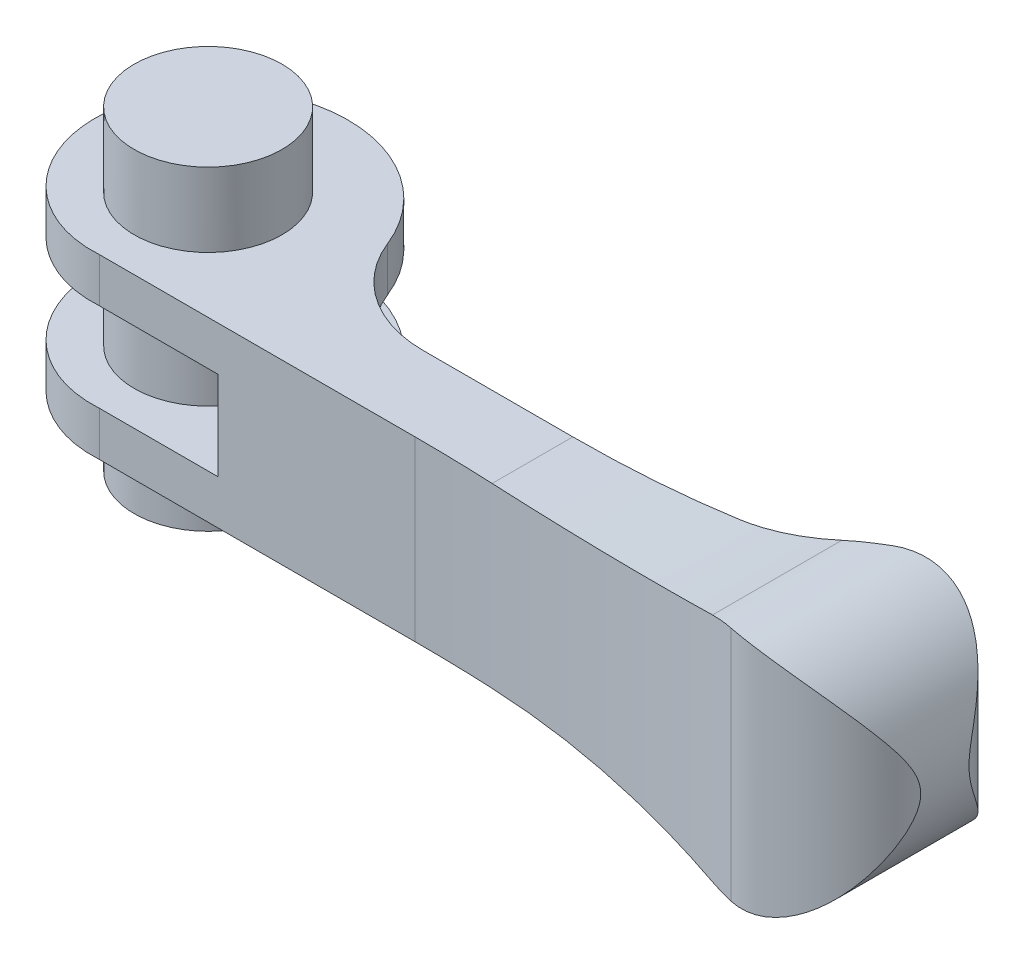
ISO-10303-21;
HEADER;
FILE_DESCRIPTION(('STEP AP214'),'2;1');
FILE_NAME('part.step','',(''),(''),'','','');
FILE_SCHEMA(('AUTOMOTIVE_DESIGN { 1 0 10303 214 1 1 1 1 }'));
ENDSEC;
DATA;
#1=APPLICATION_CONTEXT('core data for automotive mechanical design processes');
#2=APPLICATION_PROTOCOL_DEFINITION('international standard','automotive_design',2000,#1);
#3=PRODUCT_CONTEXT('',#1,'mechanical');
#4=PRODUCT('Part','Part','',(#3));
#5=PRODUCT_RELATED_PRODUCT_CATEGORY('part','',(#4));
#6=PRODUCT_DEFINITION_FORMATION('','',#4);
#7=PRODUCT_DEFINITION_CONTEXT('part definition',#1,'design');
#8=PRODUCT_DEFINITION('design','',#6,#7);
#9=PRODUCT_DEFINITION_SHAPE('','',#8);
#10=(LENGTH_UNIT() NAMED_UNIT(*) SI_UNIT(.MILLI.,.METRE.));
#11=(NAMED_UNIT(*) PLANE_ANGLE_UNIT() SI_UNIT($,.RADIAN.));
#12=(NAMED_UNIT(*) SI_UNIT($,.STERADIAN.) SOLID_ANGLE_UNIT());
#13=UNCERTAINTY_MEASURE_WITH_UNIT(LENGTH_MEASURE(1.E-05),#10,'distance_accuracy_value','');
#14=(GEOMETRIC_REPRESENTATION_CONTEXT(3) GLOBAL_UNCERTAINTY_ASSIGNED_CONTEXT((#13)) GLOBAL_UNIT_ASSIGNED_CONTEXT((#10,
#11,#12)) REPRESENTATION_CONTEXT('',''));
#15=CARTESIAN_POINT('',(0.,0.,0.));
#16=DIRECTION('',(0.,0.,1.));
#17=DIRECTION('',(1.,0.,0.));
#18=AXIS2_PLACEMENT_3D('',#15,#16,#17);
#19=CARTESIAN_POINT('',(32.,-12.,183.));
#20=DIRECTION('',(0.,1.,0.));
#21=DIRECTION('',(1.,0.,0.));
#22=AXIS2_PLACEMENT_3D('',#19,#20,#21);
#23=CYLINDRICAL_SURFACE('',#22,172.);
#24=CARTESIAN_POINT('',(65.4577553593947,11.7276166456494,14.2855115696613));
#25=CARTESIAN_POINT('',(65.6518253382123,11.7696913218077,14.3239954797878));
#26=CARTESIAN_POINT('',(65.8468221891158,11.8069140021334,14.3630148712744));
#27=CARTESIAN_POINT('',(66.2377621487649,11.8715471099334,14.4419534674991));
#28=CARTESIAN_POINT('',(66.4337019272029,11.8989805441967,14.4818703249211));
#29=CARTESIAN_POINT('',(67.0233117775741,11.9667391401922,14.6030598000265));
#30=CARTESIAN_POINT('',(67.4184272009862,11.9924480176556,14.6857029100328));
#31=CARTESIAN_POINT('',(67.813698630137,11.9985537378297,14.7698630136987));
#32=B_SPLINE_CURVE_WITH_KNOTS('',3,(#24,#25,#26,#27,#28,#29,#30,#31),.UNSPECIFIED.,.F.,.F.,(4,2,
2,4),(0.,0.606723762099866,1.2120120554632,2.42366281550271),.UNSPECIFIED.);
#33=CARTESIAN_POINT('',(65.4577553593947,11.7276166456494,14.2855115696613));
#34=VERTEX_POINT('',#33);
#35=CARTESIAN_POINT('',(67.813698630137,11.9985537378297,14.7698630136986));
#36=VERTEX_POINT('',#35);
#37=EDGE_CURVE('E177',#34,#36,#32,.T.);
#38=ORIENTED_EDGE('',*,*,#37,.F.);
#39=CARTESIAN_POINT('',(40.,9.,11.1861472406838));
#40=CARTESIAN_POINT('',(41.0786495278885,8.99998998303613,11.236360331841));
#41=CARTESIAN_POINT('',(42.1568138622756,9.01452328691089,11.2967523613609));
#42=CARTESIAN_POINT('',(44.3110259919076,9.07252358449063,11.4377582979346));
#43=CARTESIAN_POINT('',(45.3870738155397,9.11599018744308,11.5183719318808));
#44=CARTESIAN_POINT('',(47.5315233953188,9.2314665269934,11.6993141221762));
#45=CARTESIAN_POINT('',(48.5999384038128,9.30335830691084,11.7995603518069));
#46=CARTESIAN_POINT('',(50.7323922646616,9.47544657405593,12.0197470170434));
#47=CARTESIAN_POINT('',(51.7964311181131,9.57564305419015,12.1396874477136));
#48=CARTESIAN_POINT('',(54.9804202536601,9.91831356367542,12.5286842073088));
#49=CARTESIAN_POINT('',(57.0925861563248,10.2028872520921,12.8269450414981));
#50=CARTESIAN_POINT('',(60.2423967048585,10.7124052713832,13.3311883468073));
#51=CARTESIAN_POINT('',(61.2914624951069,10.8964990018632,13.50918245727));
#52=CARTESIAN_POINT('',(63.3811325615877,11.2918145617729,13.8836170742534));
#53=CARTESIAN_POINT('',(64.4217370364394,11.5030357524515,14.0800571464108));
#54=CARTESIAN_POINT('',(65.4577553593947,11.7276166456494,14.2855115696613));
#55=B_SPLINE_CURVE_WITH_KNOTS('',3,(#39,#40,#41,#42,#43,#44,#45,#46,#47,#48,#49,#50,#51,#52,#53,
#54),.UNSPECIFIED.,.F.,.F.,(4,2,2,2,2,2,2,4),(0.,3.23928692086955,6.47853009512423,
9.70447004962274,12.9304091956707,19.3812550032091,22.6204269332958,25.8595226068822),.UNSPECIFIED.);
#56=CARTESIAN_POINT('',(40.,9.,11.1861472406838));
#57=VERTEX_POINT('',#56);
#58=EDGE_CURVE('E145',#57,#34,#55,.T.);
#59=ORIENTED_EDGE('',*,*,#58,.F.);
#60=CARTESIAN_POINT('',(32.,9.,183.));
#61=DIRECTION('',(0.,1.,0.));
#62=DIRECTION('',(1.,0.,0.));
#63=AXIS2_PLACEMENT_3D('',#60,#61,#62);
#64=CIRCLE('',#63,172.);
#65=CARTESIAN_POINT('',(32.,9.,11.));
#66=VERTEX_POINT('',#65);
#67=EDGE_CURVE('E154',#66,#57,#64,.F.);
#68=ORIENTED_EDGE('',*,*,#67,.F.);
#69=DIRECTION('',(0.,1.,0.));
#70=VECTOR('',#69,1.);
#71=CARTESIAN_POINT('',(32.,-12.,11.));
#72=LINE('',#71,#70);
#73=CARTESIAN_POINT('',(32.,-9.,11.));
#74=VERTEX_POINT('',#73);
#75=EDGE_CURVE('E303',#74,#66,#72,.T.);
#76=ORIENTED_EDGE('',*,*,#75,.F.);
#77=CARTESIAN_POINT('',(32.,-9.,183.));
#78=DIRECTION('',(0.,1.,0.));
#79=DIRECTION('',(1.,0.,0.));
#80=AXIS2_PLACEMENT_3D('',#77,#78,#79);
#81=CIRCLE('',#80,172.);
#82=CARTESIAN_POINT('',(40.,-9.,11.1861472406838));
#83=VERTEX_POINT('',#82);
#84=EDGE_CURVE('E511',#74,#83,#81,.F.);
#85=ORIENTED_EDGE('',*,*,#84,.T.);
#86=CARTESIAN_POINT('',(40.,-9.,11.1861472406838));
#87=CARTESIAN_POINT('',(41.0786495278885,-8.99998998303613,11.236360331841));
#88=CARTESIAN_POINT('',(42.1568138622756,-9.01452328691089,11.2967523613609));
#89=CARTESIAN_POINT('',(44.3110259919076,-9.07252358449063,11.4377582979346));
#90=CARTESIAN_POINT('',(45.3870738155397,-9.11599018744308,11.5183719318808));
#91=CARTESIAN_POINT('',(47.5315233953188,-9.2314665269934,11.6993141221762));
#92=CARTESIAN_POINT('',(48.5999384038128,-9.30335830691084,11.7995603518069));
#93=CARTESIAN_POINT('',(50.7323922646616,-9.47544657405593,12.0197470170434));
#94=CARTESIAN_POINT('',(51.7964311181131,-9.57564305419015,12.1396874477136));
#95=CARTESIAN_POINT('',(54.9804202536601,-9.91831356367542,12.5286842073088));
#96=CARTESIAN_POINT('',(57.0925861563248,-10.2028872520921,12.8269450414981));
#97=CARTESIAN_POINT('',(60.2423967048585,-10.7124052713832,13.3311883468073));
#98=CARTESIAN_POINT('',(61.2914624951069,-10.8964990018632,13.50918245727));
#99=CARTESIAN_POINT('',(63.3811325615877,-11.2918145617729,13.8836170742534));
#100=CARTESIAN_POINT('',(64.4217370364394,-11.5030357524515,14.0800571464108));
#101=CARTESIAN_POINT('',(65.4577553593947,-11.7276166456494,14.2855115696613));
#102=B_SPLINE_CURVE_WITH_KNOTS('',3,(#86,#87,#88,#89,#90,#91,#92,#93,#94,#95,#96,#97,#98,#99,
#100,#101),.UNSPECIFIED.,.F.,.F.,(4,2,2,2,2,2,2,4),(0.,3.23928692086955,6.47853009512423,
9.70447004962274,12.9304091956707,19.3812550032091,22.6204269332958,25.8595226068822),.UNSPECIFIED.);
#103=CARTESIAN_POINT('',(65.4577553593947,-11.7276166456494,14.2855115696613));
#104=VERTEX_POINT('',#103);
#105=EDGE_CURVE('E512',#83,#104,#102,.T.);
#106=ORIENTED_EDGE('',*,*,#105,.T.);
#107=CARTESIAN_POINT('',(65.4577553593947,-11.7276166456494,14.2855115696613));
#108=CARTESIAN_POINT('',(65.6518253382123,-11.7696913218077,14.3239954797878));
#109=CARTESIAN_POINT('',(65.8468221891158,-11.8069140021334,14.3630148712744));
#110=CARTESIAN_POINT('',(66.2377621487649,-11.8715471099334,14.4419534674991));
#111=CARTESIAN_POINT('',(66.4337019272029,-11.8989805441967,14.4818703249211));
#112=CARTESIAN_POINT('',(67.0233117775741,-11.9667391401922,14.6030598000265));
#113=CARTESIAN_POINT('',(67.4184272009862,-11.9924480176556,14.6857029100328));
#114=CARTESIAN_POINT('',(67.813698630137,-11.9985537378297,14.7698630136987));
#115=B_SPLINE_CURVE_WITH_KNOTS('',3,(#107,#108,#109,#110,#111,#112,#113,#114),.UNSPECIFIED.,.F.,
.F.,(4,2,2,4),(0.,0.606723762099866,1.2120120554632,2.42366281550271),.UNSPECIFIED.);
#116=CARTESIAN_POINT('',(67.813698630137,-11.9985537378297,14.7698630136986));
#117=VERTEX_POINT('',#116);
#118=EDGE_CURVE('E223',#104,#117,#115,.T.);
#119=ORIENTED_EDGE('',*,*,#118,.T.);
#120=DIRECTION('',(0.,1.,0.));
#121=VECTOR('',#120,1.);
#122=CARTESIAN_POINT('',(67.813698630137,-12.,14.7698630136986));
#123=LINE('',#122,#121);
#124=EDGE_CURVE('E286',#117,#36,#123,.T.);
#125=ORIENTED_EDGE('',*,*,#124,.T.);
#126=EDGE_LOOP('',(#38,#59,#68,#76,#85,#106,#119,#125));
#127=FACE_BOUND('',#126,.T.);
#128=ADVANCED_FACE('F14',(#127),#23,.F.);
#129=CARTESIAN_POINT('',(-1.15218884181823E-13,-12.,11.));
#130=DIRECTION('',(0.,0.,-1.));
#131=DIRECTION('',(1.,0.,0.));
#132=AXIS2_PLACEMENT_3D('',#129,#130,#131);
#133=PLANE('',#132);
#134=DIRECTION('',(1.,0.,0.));
#135=VECTOR('',#134,1.);
#136=CARTESIAN_POINT('',(-1.17217041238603E-13,9.,11.));
#137=LINE('',#136,#135);
#138=CARTESIAN_POINT('',(-1.15218884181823E-13,9.,11.));
#139=VERTEX_POINT('',#138);
#140=EDGE_CURVE('E165',#139,#66,#137,.T.);
#141=ORIENTED_EDGE('',*,*,#140,.F.);
#142=DIRECTION('',(0.,1.,0.));
#143=VECTOR('',#142,1.);
#144=CARTESIAN_POINT('',(-1.15218884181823E-13,-12.,11.));
#145=LINE('',#144,#143);
#146=CARTESIAN_POINT('',(-1.15218884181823E-13,4.5,11.));
#147=VERTEX_POINT('',#146);
#148=EDGE_CURVE('E294',#147,#139,#145,.T.);
#149=ORIENTED_EDGE('',*,*,#148,.F.);
#150=DIRECTION('',(1.,0.,0.));
#151=VECTOR('',#150,1.);
#152=CARTESIAN_POINT('',(-1.13133819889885E-13,4.5,11.));
#153=LINE('',#152,#151);
#154=CARTESIAN_POINT('',(12.,4.5,11.));
#155=VERTEX_POINT('',#154);
#156=EDGE_CURVE('E42',#147,#155,#153,.T.);
#157=ORIENTED_EDGE('',*,*,#156,.T.);
#158=DIRECTION('',(0.,-1.,0.));
#159=VECTOR('',#158,1.);
#160=CARTESIAN_POINT('',(12.,-12.,11.));
#161=LINE('',#160,#159);
#162=CARTESIAN_POINT('',(12.,-4.5,11.));
#163=VERTEX_POINT('',#162);
#164=EDGE_CURVE('E367',#155,#163,#161,.T.);
#165=ORIENTED_EDGE('',*,*,#164,.T.);
#166=DIRECTION('',(-1.,0.,0.));
#167=VECTOR('',#166,1.);
#168=CARTESIAN_POINT('',(-1.14271127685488E-13,-4.5,11.));
#169=LINE('',#168,#167);
#170=CARTESIAN_POINT('',(-1.15218884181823E-13,-4.5,11.));
#171=VERTEX_POINT('',#170);
#172=EDGE_CURVE('E361',#163,#171,#169,.T.);
#173=ORIENTED_EDGE('',*,*,#172,.T.);
#174=CARTESIAN_POINT('',(-1.15218884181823E-13,-9.,11.));
#175=VERTEX_POINT('',#174);
#176=EDGE_CURVE('E298',#175,#171,#145,.T.);
#177=ORIENTED_EDGE('',*,*,#176,.F.);
#178=DIRECTION('',(1.,0.,0.));
#179=VECTOR('',#178,1.);
#180=CARTESIAN_POINT('',(-1.14933433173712E-13,-9.,11.));
#181=LINE('',#180,#179);
#182=EDGE_CURVE('E514',#175,#74,#181,.T.);
#183=ORIENTED_EDGE('',*,*,#182,.T.);
#184=ORIENTED_EDGE('',*,*,#75,.T.);
#185=EDGE_LOOP('',(#141,#149,#157,#165,#173,#177,#183,#184));
#186=FACE_BOUND('',#185,.T.);
#187=ADVANCED_FACE('F274',(#186),#133,.F.);
#188=CARTESIAN_POINT('',(-1.15218884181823E-13,-12.,11.));
#189=CARTESIAN_POINT('',(-1.43989663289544,-12.,11.1006875));
#190=CARTESIAN_POINT('',(-2.91975951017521,-12.,10.9148769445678));
#191=CARTESIAN_POINT('',(-5.73046463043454,-12.,9.96861149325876));
#192=CARTESIAN_POINT('',(-7.06008014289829,-12.,9.20823718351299));
#193=CARTESIAN_POINT('',(-9.35063081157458,-12.,7.20247377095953));
#194=CARTESIAN_POINT('',(-10.3104414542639,-12.,5.95765057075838));
#195=CARTESIAN_POINT('',(-11.6893244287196,-12.,3.15495082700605));
#196=CARTESIAN_POINT('',(-12.1075625,-12.,1.59805618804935));
#197=CARTESIAN_POINT('',(-12.3089375,-12.,-1.59805618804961));
#198=CARTESIAN_POINT('',(-12.0916794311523,-12.,-3.23601639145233));
#199=CARTESIAN_POINT('',(-11.0243638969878,-12.,-6.33896226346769));
#200=CARTESIAN_POINT('',(-10.1744346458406,-12.,-7.80260621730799));
#201=CARTESIAN_POINT('',(-7.94499984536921,-12.,-10.3168282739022));
#202=CARTESIAN_POINT('',(-6.56614820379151,-12.,-11.366193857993));
#203=CARTESIAN_POINT('',(-3.47120770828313,-12.,-12.8661269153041));
#204=CARTESIAN_POINT('',(-1.75621574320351,-12.,-13.3158125));
#205=CARTESIAN_POINT('',(1.75621574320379,-12.,-13.5171875));
#206=CARTESIAN_POINT('',(3.55227327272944,-12.,-13.2684819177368));
#207=CARTESIAN_POINT('',(6.94745989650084,-12.,-12.0801163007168));
#208=CARTESIAN_POINT('',(8.54513229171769,-12.,-11.1406321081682));
#209=CARTESIAN_POINT('',(11.2830257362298,-12.,-8.6875259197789));
#210=CARTESIAN_POINT('',(12.421946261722,-12.,-7.17464583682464));
#211=CARTESIAN_POINT('',(14.0429294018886,-12.,-3.78746458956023));
#212=CARTESIAN_POINT('',(14.5240625,-12.,-1.91437529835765));
#213=CARTESIAN_POINT('',(14.7254375,-12.,1.91437529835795));
#214=CARTESIAN_POINT('',(14.4452844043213,-12.,3.86853015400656));
#215=CARTESIAN_POINT('',(13.1358687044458,-12.,7.555957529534));
#216=CARTESIAN_POINT('',(12.1068295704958,-12.,9.28765836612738));
#217=CARTESIAN_POINT('',(9.43005199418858,-12.,12.2492231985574));
#218=CARTESIAN_POINT('',(7.78314346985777,-12.,13.4776986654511));
#219=CARTESIAN_POINT('',(4.10372147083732,-12.,15.2197318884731));
#220=CARTESIAN_POINT('',(2.0725348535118,-12.,15.7323125));
#221=CARTESIAN_POINT('',(-1.6196390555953E-13,-12.,15.833));
#222=B_SPLINE_CURVE_WITH_KNOTS('',3,(#188,#189,#190,#191,#192,#193,#194,#195,#196,#197,#198,
#199,#200,#201,#202,#203,#204,#205,#206,#207,#208,#209,#210,#211,#212,#213,#214,#215,#216,#217,
#218,#219,#220,#221),.UNSPECIFIED.,.F.,.F.,(4,2,2,2,2,2,2,2,2,2,2,2,2,2,2,2,4),(0.,0.0625,0.125,
0.1875,0.25,0.3125,0.375,0.4375,0.5,0.5625,0.625,0.6875,0.75,0.8125,0.875,0.9375,1.),.UNSPECIFIED.);
#223=DIRECTION('',(0.,1.,0.));
#224=VECTOR('',#223,1.);
#225=SURFACE_OF_LINEAR_EXTRUSION('',#222,#224);
#226=CARTESIAN_POINT('',(-1.15218884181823E-13,9.,11.));
#227=CARTESIAN_POINT('',(-1.43989663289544,9.,11.1006875));
#228=CARTESIAN_POINT('',(-2.91975951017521,9.,10.9148769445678));
#229=CARTESIAN_POINT('',(-5.73046463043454,9.,9.96861149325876));
#230=CARTESIAN_POINT('',(-7.06008014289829,9.,9.20823718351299));
#231=CARTESIAN_POINT('',(-9.35063081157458,9.,7.20247377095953));
#232=CARTESIAN_POINT('',(-10.3104414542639,9.,5.95765057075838));
#233=CARTESIAN_POINT('',(-11.6893244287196,9.,3.15495082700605));
#234=CARTESIAN_POINT('',(-12.1075625,9.,1.59805618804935));
#235=CARTESIAN_POINT('',(-12.3089375,9.,-1.59805618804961));
#236=CARTESIAN_POINT('',(-12.0916794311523,9.,-3.23601639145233));
#237=CARTESIAN_POINT('',(-11.0243638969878,9.,-6.33896226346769));
#238=CARTESIAN_POINT('',(-10.1744346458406,9.,-7.80260621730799));
#239=CARTESIAN_POINT('',(-7.94499984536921,9.,-10.3168282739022));
#240=CARTESIAN_POINT('',(-6.56614820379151,9.,-11.366193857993));
#241=CARTESIAN_POINT('',(-3.47120770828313,9.,-12.8661269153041));
#242=CARTESIAN_POINT('',(-1.75621574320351,9.,-13.3158125));
#243=CARTESIAN_POINT('',(1.75621574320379,9.,-13.5171875));
#244=CARTESIAN_POINT('',(3.55227327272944,9.,-13.2684819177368));
#245=CARTESIAN_POINT('',(6.94745989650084,9.,-12.0801163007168));
#246=CARTESIAN_POINT('',(8.54513229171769,9.,-11.1406321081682));
#247=CARTESIAN_POINT('',(11.2830257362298,9.,-8.6875259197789));
#248=CARTESIAN_POINT('',(12.421946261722,9.,-7.17464583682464));
#249=CARTESIAN_POINT('',(14.0429294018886,9.,-3.78746458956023));
#250=CARTESIAN_POINT('',(14.5240625,9.,-1.91437529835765));
#251=CARTESIAN_POINT('',(14.7254375,9.,1.91437529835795));
#252=CARTESIAN_POINT('',(14.4452844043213,9.,3.86853015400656));
#253=CARTESIAN_POINT('',(13.1358687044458,9.,7.555957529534));
#254=CARTESIAN_POINT('',(12.1068295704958,9.,9.28765836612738));
#255=CARTESIAN_POINT('',(9.43005199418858,9.,12.2492231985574));
#256=CARTESIAN_POINT('',(7.78314346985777,9.,13.4776986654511));
#257=CARTESIAN_POINT('',(4.10372147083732,9.,15.2197318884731));
#258=CARTESIAN_POINT('',(2.0725348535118,9.,15.7323125));
#259=CARTESIAN_POINT('',(-1.6196390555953E-13,9.,15.833));
#260=B_SPLINE_CURVE_WITH_KNOTS('',3,(#226,#227,#228,#229,#230,#231,#232,#233,#234,#235,#236,
#237,#238,#239,#240,#241,#242,#243,#244,#245,#246,#247,#248,#249,#250,#251,#252,#253,#254,#255,
#256,#257,#258,#259),.UNSPECIFIED.,.F.,.F.,(4,2,2,2,2,2,2,2,2,2,2,2,2,2,2,2,4),(0.,0.0625,0.125,
0.1875,0.25,0.3125,0.375,0.4375,0.5,0.5625,0.625,0.6875,0.75,0.8125,0.875,0.9375,1.),.UNSPECIFIED.);
#261=CARTESIAN_POINT('',(13.6259439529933,9.,-4.57987700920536));
#262=VERTEX_POINT('',#261);
#263=EDGE_CURVE('E163',#262,#139,#260,.F.);
#264=ORIENTED_EDGE('',*,*,#263,.F.);
#265=DIRECTION('',(0.,1.,0.));
#266=VECTOR('',#265,1.);
#267=CARTESIAN_POINT('',(13.6259439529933,12.,-4.57987700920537));
#268=LINE('',#267,#266);
#269=CARTESIAN_POINT('',(13.6259439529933,4.5,-4.57987700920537));
#270=VERTEX_POINT('',#269);
#271=EDGE_CURVE('E35',#262,#270,#268,.F.);
#272=ORIENTED_EDGE('',*,*,#271,.T.);
#273=CARTESIAN_POINT('',(-1.15218884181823E-13,4.5,11.));
#274=CARTESIAN_POINT('',(-1.43989663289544,4.5,11.1006875));
#275=CARTESIAN_POINT('',(-2.91975951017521,4.5,10.9148769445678));
#276=CARTESIAN_POINT('',(-5.73046463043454,4.5,9.96861149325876));
#277=CARTESIAN_POINT('',(-7.06008014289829,4.5,9.20823718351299));
#278=CARTESIAN_POINT('',(-9.35063081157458,4.5,7.20247377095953));
#279=CARTESIAN_POINT('',(-10.3104414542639,4.5,5.95765057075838));
#280=CARTESIAN_POINT('',(-11.6893244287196,4.5,3.15495082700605));
#281=CARTESIAN_POINT('',(-12.1075625,4.5,1.59805618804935));
#282=CARTESIAN_POINT('',(-12.3089375,4.5,-1.59805618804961));
#283=CARTESIAN_POINT('',(-12.0916794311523,4.5,-3.23601639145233));
#284=CARTESIAN_POINT('',(-11.0243638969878,4.5,-6.33896226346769));
#285=CARTESIAN_POINT('',(-10.1744346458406,4.5,-7.80260621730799));
#286=CARTESIAN_POINT('',(-7.94499984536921,4.5,-10.3168282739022));
#287=CARTESIAN_POINT('',(-6.56614820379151,4.5,-11.366193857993));
#288=CARTESIAN_POINT('',(-3.47120770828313,4.5,-12.8661269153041));
#289=CARTESIAN_POINT('',(-1.75621574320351,4.5,-13.3158125));
#290=CARTESIAN_POINT('',(1.75621574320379,4.5,-13.5171875));
#291=CARTESIAN_POINT('',(3.55227327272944,4.5,-13.2684819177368));
#292=CARTESIAN_POINT('',(6.94745989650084,4.5,-12.0801163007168));
#293=CARTESIAN_POINT('',(8.54513229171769,4.5,-11.1406321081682));
#294=CARTESIAN_POINT('',(11.2830257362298,4.5,-8.6875259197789));
#295=CARTESIAN_POINT('',(12.421946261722,4.5,-7.17464583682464));
#296=CARTESIAN_POINT('',(14.0429294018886,4.5,-3.78746458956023));
#297=CARTESIAN_POINT('',(14.5240625,4.5,-1.91437529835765));
#298=CARTESIAN_POINT('',(14.7254375,4.5,1.91437529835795));
#299=CARTESIAN_POINT('',(14.4452844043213,4.5,3.86853015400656));
#300=CARTESIAN_POINT('',(13.1358687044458,4.5,7.555957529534));
#301=CARTESIAN_POINT('',(12.1068295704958,4.5,9.28765836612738));
#302=CARTESIAN_POINT('',(9.43005199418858,4.5,12.2492231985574));
#303=CARTESIAN_POINT('',(7.78314346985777,4.5,13.4776986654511));
#304=CARTESIAN_POINT('',(4.10372147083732,4.5,15.2197318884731));
#305=CARTESIAN_POINT('',(2.0725348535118,4.5,15.7323125));
#306=CARTESIAN_POINT('',(-1.6196390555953E-13,4.5,15.833));
#307=B_SPLINE_CURVE_WITH_KNOTS('',3,(#273,#274,#275,#276,#277,#278,#279,#280,#281,#282,#283,
#284,#285,#286,#287,#288,#289,#290,#291,#292,#293,#294,#295,#296,#297,#298,#299,#300,#301,#302,
#303,#304,#305,#306),.UNSPECIFIED.,.F.,.F.,(4,2,2,2,2,2,2,2,2,2,2,2,2,2,2,2,4),(0.,0.0625,0.125,
0.1875,0.25,0.3125,0.375,0.4375,0.5,0.5625,0.625,0.6875,0.75,0.8125,0.875,0.9375,1.),.UNSPECIFIED.);
#308=EDGE_CURVE('E309',#270,#147,#307,.F.);
#309=ORIENTED_EDGE('',*,*,#308,.T.);
#310=ORIENTED_EDGE('',*,*,#148,.T.);
#311=EDGE_LOOP('',(#264,#272,#309,#310));
#312=FACE_BOUND('',#311,.T.);
#313=ADVANCED_FACE('F280',(#312),#225,.F.);
#314=CARTESIAN_POINT('',(14.473395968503,-12.,3.));
#315=DIRECTION('',(0.,0.,1.));
#316=DIRECTION('',(-1.,0.,0.));
#317=AXIS2_PLACEMENT_3D('',#314,#315,#316);
#318=PLANE('',#317);
#319=CARTESIAN_POINT('',(40.,129.166666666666,3.));
#320=DIRECTION('',(0.,0.,1.));
#321=DIRECTION('',(-1.,0.,0.));
#322=AXIS2_PLACEMENT_3D('',#319,#320,#321);
#323=CIRCLE('',#322,120.166666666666);
#324=CARTESIAN_POINT('',(56.8754845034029,10.1908464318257,3.));
#325=VERTEX_POINT('',#324);
#326=CARTESIAN_POINT('',(40.,9.,3.));
#327=VERTEX_POINT('',#326);
#328=EDGE_CURVE('E134',#325,#327,#323,.F.);
#329=ORIENTED_EDGE('',*,*,#328,.F.);
#330=DIRECTION('',(0.,1.,0.));
#331=VECTOR('',#330,1.);
#332=CARTESIAN_POINT('',(56.8754845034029,-12.,3.));
#333=LINE('',#332,#331);
#334=CARTESIAN_POINT('',(56.8754845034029,-10.1908464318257,3.));
#335=VERTEX_POINT('',#334);
#336=EDGE_CURVE('E290',#335,#325,#333,.T.);
#337=ORIENTED_EDGE('',*,*,#336,.F.);
#338=CARTESIAN_POINT('',(40.,-129.166666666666,3.));
#339=DIRECTION('',(0.,0.,1.));
#340=DIRECTION('',(-1.,0.,0.));
#341=AXIS2_PLACEMENT_3D('',#338,#339,#340);
#342=CIRCLE('',#341,120.166666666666);
#343=CARTESIAN_POINT('',(40.,-9.,3.));
#344=VERTEX_POINT('',#343);
#345=EDGE_CURVE('E258',#335,#344,#342,.T.);
#346=ORIENTED_EDGE('',*,*,#345,.T.);
#347=DIRECTION('',(-1.,0.,0.));
#348=VECTOR('',#347,1.);
#349=CARTESIAN_POINT('',(14.473395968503,-9.,3.));
#350=LINE('',#349,#348);
#351=CARTESIAN_POINT('',(24.7822207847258,-9.,3.));
#352=VERTEX_POINT('',#351);
#353=EDGE_CURVE('E330',#344,#352,#350,.T.);
#354=ORIENTED_EDGE('',*,*,#353,.T.);
#355=DIRECTION('',(0.,-1.,0.));
#356=VECTOR('',#355,1.);
#357=CARTESIAN_POINT('',(24.7822207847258,12.,3.));
#358=LINE('',#357,#356);
#359=CARTESIAN_POINT('',(24.7822207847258,-4.5,3.));
#360=VERTEX_POINT('',#359);
#361=EDGE_CURVE('E315',#352,#360,#358,.F.);
#362=ORIENTED_EDGE('',*,*,#361,.T.);
#363=DIRECTION('',(-1.,0.,0.));
#364=VECTOR('',#363,1.);
#365=CARTESIAN_POINT('',(30.,-4.5,3.));
#366=LINE('',#365,#364);
#367=CARTESIAN_POINT('',(12.,-4.5,3.));
#368=VERTEX_POINT('',#367);
#369=EDGE_CURVE('E341',#360,#368,#366,.T.);
#370=ORIENTED_EDGE('',*,*,#369,.T.);
#371=DIRECTION('',(0.,1.,0.));
#372=VECTOR('',#371,1.);
#373=CARTESIAN_POINT('',(12.,-4.5,3.));
#374=LINE('',#373,#372);
#375=CARTESIAN_POINT('',(12.,4.5,3.));
#376=VERTEX_POINT('',#375);
#377=EDGE_CURVE('E339',#368,#376,#374,.T.);
#378=ORIENTED_EDGE('',*,*,#377,.T.);
#379=DIRECTION('',(-1.,0.,0.));
#380=VECTOR('',#379,1.);
#381=CARTESIAN_POINT('',(30.,4.5,3.));
#382=LINE('',#381,#380);
#383=CARTESIAN_POINT('',(24.7822207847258,4.5,3.));
#384=VERTEX_POINT('',#383);
#385=EDGE_CURVE('E336',#384,#376,#382,.T.);
#386=ORIENTED_EDGE('',*,*,#385,.F.);
#387=CARTESIAN_POINT('',(24.7822207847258,9.,3.00000000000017));
#388=VERTEX_POINT('',#387);
#389=EDGE_CURVE('E162',#384,#388,#358,.F.);
#390=ORIENTED_EDGE('',*,*,#389,.T.);
#391=DIRECTION('',(-1.,0.,0.));
#392=VECTOR('',#391,1.);
#393=CARTESIAN_POINT('',(14.4733959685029,9.,3.));
#394=LINE('',#393,#392);
#395=EDGE_CURVE('E151',#327,#388,#394,.T.);
#396=ORIENTED_EDGE('',*,*,#395,.F.);
#397=EDGE_LOOP('',(#329,#337,#346,#354,#362,#370,#378,#386,#390,#396));
#398=FACE_BOUND('',#397,.T.);
#399=ADVANCED_FACE('F159',(#398),#318,.F.);
#400=CARTESIAN_POINT('',(56.8754845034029,-12.,-18.));
#401=DIRECTION('',(0.,1.,0.));
#402=DIRECTION('',(1.,0.,0.));
#403=AXIS2_PLACEMENT_3D('',#400,#401,#402);
#404=CYLINDRICAL_SURFACE('',#403,21.);
#405=CARTESIAN_POINT('',(68.7567064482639,11.9761177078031,-0.684210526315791));
#406=CARTESIAN_POINT('',(68.4948872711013,11.9926790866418,-0.504516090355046));
#407=CARTESIAN_POINT('',(68.2285287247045,12.0008685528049,-0.330536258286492));
#408=CARTESIAN_POINT('',(67.6898290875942,11.9989926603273,0.00415230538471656));
#409=CARTESIAN_POINT('',(67.4175318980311,11.9890333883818,0.164932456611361));
#410=CARTESIAN_POINT('',(66.8669276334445,11.9495739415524,0.473514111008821));
#411=CARTESIAN_POINT('',(66.5886197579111,11.9200711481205,0.621313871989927));
#412=CARTESIAN_POINT('',(66.1674255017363,11.8600994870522,0.8330760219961));
#413=CARTESIAN_POINT('',(66.0259771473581,11.8373977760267,0.902198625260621));
#414=CARTESIAN_POINT('',(65.7423486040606,11.7865928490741,1.03689540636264));
#415=CARTESIAN_POINT('',(65.6001683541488,11.7584891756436,1.10246928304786));
#416=CARTESIAN_POINT('',(65.4577553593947,11.7276166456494,1.16623664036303));
#417=B_SPLINE_CURVE_WITH_KNOTS('',3,(#405,#406,#407,#408,#409,#410,#411,#412,#413,#414,#415,
#416),.UNSPECIFIED.,.F.,.F.,(4,2,2,2,2,4),(0.,0.953856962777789,1.9021561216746,2.8505823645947,
3.32765447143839,3.80476700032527),.UNSPECIFIED.);
#418=CARTESIAN_POINT('',(68.7567064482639,11.9761177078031,-0.684210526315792));
#419=VERTEX_POINT('',#418);
#420=CARTESIAN_POINT('',(65.4577553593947,11.7276166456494,1.16623664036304));
#421=VERTEX_POINT('',#420);
#422=EDGE_CURVE('E146',#419,#421,#417,.T.);
#423=ORIENTED_EDGE('',*,*,#422,.F.);
#424=DIRECTION('',(0.,1.,0.));
#425=VECTOR('',#424,1.);
#426=CARTESIAN_POINT('',(68.7567064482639,-12.,-0.684210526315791));
#427=LINE('',#426,#425);
#428=CARTESIAN_POINT('',(68.7567064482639,-11.9761177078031,-0.684210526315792));
#429=VERTEX_POINT('',#428);
#430=EDGE_CURVE('E295',#429,#419,#427,.T.);
#431=ORIENTED_EDGE('',*,*,#430,.F.);
#432=CARTESIAN_POINT('',(68.7567064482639,-11.9761177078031,-0.684210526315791));
#433=CARTESIAN_POINT('',(68.4948872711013,-11.9926790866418,-0.504516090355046));
#434=CARTESIAN_POINT('',(68.2285287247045,-12.0008685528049,-0.330536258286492));
#435=CARTESIAN_POINT('',(67.6898290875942,-11.9989926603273,0.00415230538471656));
#436=CARTESIAN_POINT('',(67.4175318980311,-11.9890333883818,0.164932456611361));
#437=CARTESIAN_POINT('',(66.8669276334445,-11.9495739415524,0.473514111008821));
#438=CARTESIAN_POINT('',(66.5886197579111,-11.9200711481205,0.621313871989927));
#439=CARTESIAN_POINT('',(66.1674255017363,-11.8600994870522,0.8330760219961));
#440=CARTESIAN_POINT('',(66.0259771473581,-11.8373977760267,0.902198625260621));
#441=CARTESIAN_POINT('',(65.7423486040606,-11.7865928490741,1.03689540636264));
#442=CARTESIAN_POINT('',(65.6001683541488,-11.7584891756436,1.10246928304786));
#443=CARTESIAN_POINT('',(65.4577553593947,-11.7276166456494,1.16623664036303));
#444=B_SPLINE_CURVE_WITH_KNOTS('',3,(#432,#433,#434,#435,#436,#437,#438,#439,#440,#441,#442,
#443),.UNSPECIFIED.,.F.,.F.,(4,2,2,2,2,4),(0.,0.953856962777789,1.9021561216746,2.8505823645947,
3.32765447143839,3.80476700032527),.UNSPECIFIED.);
#445=CARTESIAN_POINT('',(65.4577553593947,-11.7276166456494,1.16623664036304));
#446=VERTEX_POINT('',#445);
#447=EDGE_CURVE('E224',#429,#446,#444,.T.);
#448=ORIENTED_EDGE('',*,*,#447,.T.);
#449=CARTESIAN_POINT('',(65.4577553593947,-11.7276166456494,1.16623664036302));
#450=CARTESIAN_POINT('',(65.1855545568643,-11.6686095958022,1.2881213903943));
#451=CARTESIAN_POINT('',(64.9107164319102,-11.6100239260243,1.40422753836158));
#452=CARTESIAN_POINT('',(64.3561498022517,-11.493874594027,1.62469677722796));
#453=CARTESIAN_POINT('',(64.0764211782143,-11.4363109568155,1.72905958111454));
#454=CARTESIAN_POINT('',(63.2302291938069,-11.2653723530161,2.0243388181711));
#455=CARTESIAN_POINT('',(62.6570181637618,-11.1538059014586,2.19733032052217));
#456=CARTESIAN_POINT('',(61.5069991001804,-10.9388645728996,2.49134781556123));
#457=CARTESIAN_POINT('',(60.9304274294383,-10.8353808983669,2.61322608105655));
#458=CARTESIAN_POINT('',(59.768170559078,-10.6356818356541,2.80815067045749));
#459=CARTESIAN_POINT('',(59.1824922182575,-10.5394612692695,2.88123208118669));
#460=CARTESIAN_POINT('',(58.3093493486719,-10.4027038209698,2.95294386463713));
#461=CARTESIAN_POINT('',(58.023815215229,-10.359034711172,2.97053301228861));
#462=CARTESIAN_POINT('',(57.450746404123,-10.27350646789,2.99408577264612));
#463=CARTESIAN_POINT('',(57.163208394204,-10.2316558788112,2.9999993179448));
#464=CARTESIAN_POINT('',(56.8754845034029,-10.1908464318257,3.));
#465=B_SPLINE_CURVE_WITH_KNOTS('',3,(#449,#450,#451,#452,#453,#454,#455,#456,#457,#458,#459,
#460,#461,#462,#463,#464),.UNSPECIFIED.,.F.,.F.,(4,2,2,2,2,2,2,4),(0.,0.911932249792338,
1.82388678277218,3.64865921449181,5.44166281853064,7.23337579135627,8.10133583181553,
8.97300985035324),.UNSPECIFIED.);
#466=EDGE_CURVE('E292',#446,#335,#465,.T.);
#467=ORIENTED_EDGE('',*,*,#466,.T.);
#468=ORIENTED_EDGE('',*,*,#336,.T.);
#469=CARTESIAN_POINT('',(65.4577553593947,11.7276166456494,1.16623664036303));
#470=CARTESIAN_POINT('',(65.1855545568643,11.6686095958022,1.28812139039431));
#471=CARTESIAN_POINT('',(64.9107164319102,11.6100239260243,1.40422753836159));
#472=CARTESIAN_POINT('',(64.3561498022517,11.493874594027,1.62469677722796));
#473=CARTESIAN_POINT('',(64.0764211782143,11.4363109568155,1.72905958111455));
#474=CARTESIAN_POINT('',(63.2302291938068,11.2653723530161,2.02433881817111));
#475=CARTESIAN_POINT('',(62.6570181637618,11.1538059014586,2.19733032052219));
#476=CARTESIAN_POINT('',(61.5069991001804,10.9388645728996,2.49134781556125));
#477=CARTESIAN_POINT('',(60.9304274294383,10.8353808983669,2.61322608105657));
#478=CARTESIAN_POINT('',(59.7681705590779,10.6356818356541,2.8081506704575));
#479=CARTESIAN_POINT('',(59.1824922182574,10.5394612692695,2.8812320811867));
#480=CARTESIAN_POINT('',(58.3093493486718,10.4027038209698,2.95294386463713));
#481=CARTESIAN_POINT('',(58.023815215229,10.359034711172,2.97053301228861));
#482=CARTESIAN_POINT('',(57.450746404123,10.2735064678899,2.99408577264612));
#483=CARTESIAN_POINT('',(57.163208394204,10.2316558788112,2.9999993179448));
#484=CARTESIAN_POINT('',(56.8754845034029,10.1908464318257,3.));
#485=B_SPLINE_CURVE_WITH_KNOTS('',3,(#469,#470,#471,#472,#473,#474,#475,#476,#477,#478,#479,
#480,#481,#482,#483,#484),.UNSPECIFIED.,.F.,.F.,(4,2,2,2,2,2,2,4),(0.,0.911932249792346,
1.8238867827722,3.64865921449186,5.44166281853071,7.23337579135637,8.10133583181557,
8.97300985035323),.UNSPECIFIED.);
#486=EDGE_CURVE('E9',#421,#325,#485,.T.);
#487=ORIENTED_EDGE('',*,*,#486,.F.);
#488=EDGE_LOOP('',(#423,#431,#448,#467,#468,#487));
#489=FACE_BOUND('',#488,.T.);
#490=ADVANCED_FACE('F188',(#489),#404,.F.);
#491=CARTESIAN_POINT('',(73.,-12.,5.5));
#492=DIRECTION('',(0.,1.,0.));
#493=DIRECTION('',(1.,0.,0.));
#494=AXIS2_PLACEMENT_3D('',#491,#492,#493);
#495=CYLINDRICAL_SURFACE('',#494,7.5);
#496=ORIENTED_EDGE('',*,*,#430,.T.);
#497=CARTESIAN_POINT('',(68.7567064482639,11.9761177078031,-0.684210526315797));
#498=CARTESIAN_POINT('',(68.9112030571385,11.9663790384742,-0.790258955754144));
#499=CARTESIAN_POINT('',(69.0695857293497,11.9533480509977,-0.890376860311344));
#500=CARTESIAN_POINT('',(69.3928191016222,11.9199961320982,-1.07822595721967));
#501=CARTESIAN_POINT('',(69.5576705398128,11.8996743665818,-1.16595573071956));
#502=CARTESIAN_POINT('',(69.8920280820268,11.8511062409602,-1.32824865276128));
#503=CARTESIAN_POINT('',(70.0615197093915,11.8228824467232,-1.40284832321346));
#504=CARTESIAN_POINT('',(70.4041262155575,11.7579997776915,-1.53884902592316));
#505=CARTESIAN_POINT('',(70.5772407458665,11.7213417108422,-1.60025132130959));
#506=CARTESIAN_POINT('',(70.9258470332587,11.6392238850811,-1.70980739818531));
#507=CARTESIAN_POINT('',(71.1013418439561,11.5937515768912,-1.75794205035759));
#508=CARTESIAN_POINT('',(71.452949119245,11.4939349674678,-1.84093082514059));
#509=CARTESIAN_POINT('',(71.6290616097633,11.4395902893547,-1.87578438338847));
#510=CARTESIAN_POINT('',(71.9804008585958,11.3221337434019,-1.93250148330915));
#511=CARTESIAN_POINT('',(72.1556277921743,11.2590236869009,-1.95436770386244));
#512=CARTESIAN_POINT('',(72.5038946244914,11.1242886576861,-1.98561622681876));
#513=CARTESIAN_POINT('',(72.6769345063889,11.0526636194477,-1.9949984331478));
#514=CARTESIAN_POINT('',(73.0213195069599,10.9005564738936,-2.0019663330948));
#515=CARTESIAN_POINT('',(73.1926317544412,10.8199949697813,-1.99943636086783));
#516=CARTESIAN_POINT('',(73.5308067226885,10.6510987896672,-1.98310804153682));
#517=CARTESIAN_POINT('',(73.6976695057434,10.5627642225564,-1.96930985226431));
#518=CARTESIAN_POINT('',(74.0262307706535,10.3788250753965,-1.93129979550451));
#519=CARTESIAN_POINT('',(74.1879262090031,10.2832163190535,-1.90708190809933));
#520=CARTESIAN_POINT('',(74.5054473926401,10.085344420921,-1.84912826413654));
#521=CARTESIAN_POINT('',(74.6612718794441,9.98307986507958,-1.8153904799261));
#522=CARTESIAN_POINT('',(75.0394601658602,9.72219222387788,-1.72112262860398));
#523=CARTESIAN_POINT('',(75.2580875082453,9.5599648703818,-1.65549035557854));
#524=CARTESIAN_POINT('',(75.6805804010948,9.22396978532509,-1.50818004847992));
#525=CARTESIAN_POINT('',(75.8844402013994,9.050197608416,-1.42649580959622));
#526=CARTESIAN_POINT('',(76.2773248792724,8.692331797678,-1.24949231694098));
#527=CARTESIAN_POINT('',(76.4663206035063,8.50821903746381,-1.15414725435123));
#528=CARTESIAN_POINT('',(76.828957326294,8.13129301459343,-0.952298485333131));
#529=CARTESIAN_POINT('',(77.0025985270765,7.93847986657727,-0.845794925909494));
#530=CARTESIAN_POINT('',(77.4015250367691,7.46603138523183,-0.579065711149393));
#531=CARTESIAN_POINT('',(77.6194897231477,7.18266876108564,-0.414462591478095));
#532=CARTESIAN_POINT('',(78.0263848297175,6.60281683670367,-0.0727957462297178));
#533=CARTESIAN_POINT('',(78.2152998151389,6.30632066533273,0.104274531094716));
#534=CARTESIAN_POINT('',(78.5649173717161,5.70128416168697,0.465628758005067));
#535=CARTESIAN_POINT('',(78.7256128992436,5.39274084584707,0.649914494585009));
#536=CARTESIAN_POINT('',(79.0194115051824,4.76373066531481,1.01979065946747));
#537=CARTESIAN_POINT('',(79.152527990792,4.4432696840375,1.20538040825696));
#538=CARTESIAN_POINT('',(79.3371059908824,3.93776025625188,1.4868659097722));
#539=CARTESIAN_POINT('',(79.3981516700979,3.75748370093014,1.58512984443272));
#540=CARTESIAN_POINT('',(79.5121035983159,3.3923557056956,1.77776933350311));
#541=CARTESIAN_POINT('',(79.5650112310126,3.20750504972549,1.8721455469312));
#542=CARTESIAN_POINT('',(79.6625437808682,2.83241946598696,2.05453921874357));
#543=CARTESIAN_POINT('',(79.7071665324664,2.64218314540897,2.14255501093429));
#544=CARTESIAN_POINT('',(79.7877404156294,2.25570899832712,2.30859116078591));
#545=CARTESIAN_POINT('',(79.823693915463,2.05947282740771,2.38661424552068));
#546=CARTESIAN_POINT('',(79.9017293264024,1.56183639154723,2.56241994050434));
#547=CARTESIAN_POINT('',(79.9381920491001,1.25599112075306,2.65117149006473));
#548=CARTESIAN_POINT('',(79.975061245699,0.788768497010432,2.74325667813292));
#549=CARTESIAN_POINT('',(79.9843785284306,0.632128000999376,2.767100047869));
#550=CARTESIAN_POINT('',(79.9968469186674,0.31699058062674,2.79917793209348));
#551=CARTESIAN_POINT('',(79.9999998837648,0.158494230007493,2.80741714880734));
#552=CARTESIAN_POINT('',(80.0000001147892,-0.156522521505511,2.8074180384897));
#553=CARTESIAN_POINT('',(79.9969253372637,-0.313042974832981,2.79938342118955));
#554=CARTESIAN_POINT('',(79.9847633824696,-0.624296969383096,2.76808673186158));
#555=CARTESIAN_POINT('',(79.975674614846,-0.779030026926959,2.74482063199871));
#556=CARTESIAN_POINT('',(79.9396926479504,-1.24071021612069,2.654859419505));
#557=CARTESIAN_POINT('',(79.9040902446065,-1.54304849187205,2.56804611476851));
#558=CARTESIAN_POINT('',(79.8178587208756,-2.099767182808,2.37321688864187));
#559=CARTESIAN_POINT('',(79.7693080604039,-2.3557689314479,2.26857440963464));
#560=CARTESIAN_POINT('',(79.6575369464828,-2.8579564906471,2.04413665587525));
#561=CARTESIAN_POINT('',(79.5943016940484,-3.10413210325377,1.92432615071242));
#562=CARTESIAN_POINT('',(79.4536884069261,-3.58841244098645,1.6763526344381));
#563=CARTESIAN_POINT('',(79.3762919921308,-3.82650619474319,1.54817890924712));
#564=CARTESIAN_POINT('',(79.2076178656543,-4.29550190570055,1.28816916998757));
#565=CARTESIAN_POINT('',(79.1163459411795,-4.52640681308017,1.15633470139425));
#566=CARTESIAN_POINT('',(78.9021008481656,-5.02293901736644,0.868264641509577));
#567=CARTESIAN_POINT('',(78.7763790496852,-5.28731934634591,0.711915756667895));
#568=CARTESIAN_POINT('',(78.5050923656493,-5.8076783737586,0.402316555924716));
#569=CARTESIAN_POINT('',(78.3595230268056,-6.06365517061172,0.249066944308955));
#570=CARTESIAN_POINT('',(78.0482772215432,-6.5665344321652,-0.0508119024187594));
#571=CARTESIAN_POINT('',(77.8826316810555,-6.81345010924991,-0.197450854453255));
#572=CARTESIAN_POINT('',(77.5306688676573,-7.29767180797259,-0.481152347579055));
#573=CARTESIAN_POINT('',(77.344356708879,-7.53498018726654,-0.618217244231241));
#574=CARTESIAN_POINT('',(76.8295292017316,-8.14125501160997,-0.959877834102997));
#575=CARTESIAN_POINT('',(76.4838109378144,-8.5018336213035,-1.15441495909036));
#576=CARTESIAN_POINT('',(75.9239935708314,-9.01523939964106,-1.40958333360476));
#577=CARTESIAN_POINT('',(75.7305106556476,-9.18180034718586,-1.48853431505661));
#578=CARTESIAN_POINT('',(75.3299871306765,-9.50459594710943,-1.63206631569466));
#579=CARTESIAN_POINT('',(75.1229494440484,-9.66083281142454,-1.69665042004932));
#580=CARTESIAN_POINT('',(74.7380663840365,-9.93189180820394,-1.79798423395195));
#581=CARTESIAN_POINT('',(74.5624806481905,-10.0488186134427,-1.83770974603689));
#582=CARTESIAN_POINT('',(74.2037132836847,-10.2741804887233,-1.90502307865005));
#583=CARTESIAN_POINT('',(74.0205334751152,-10.3826175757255,-1.93261378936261));
#584=CARTESIAN_POINT('',(73.6475868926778,-10.5901020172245,-1.97434346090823));
#585=CARTESIAN_POINT('',(73.4578247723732,-10.6891558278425,-1.98849173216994));
#586=CARTESIAN_POINT('',(73.0728145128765,-10.8771520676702,-2.00211939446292));
#587=CARTESIAN_POINT('',(72.8775664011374,-10.9660945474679,-2.00159885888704));
#588=CARTESIAN_POINT('',(72.4815476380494,-11.1338372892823,-1.98470380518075));
#589=CARTESIAN_POINT('',(72.2807452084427,-11.2125502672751,-1.96820186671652));
#590=CARTESIAN_POINT('',(71.8770430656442,-11.3584596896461,-1.91824351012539));
#591=CARTESIAN_POINT('',(71.6741432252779,-11.4256554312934,-1.88478605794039));
#592=CARTESIAN_POINT('',(71.2684370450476,-11.5482554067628,-1.80031471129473));
#593=CARTESIAN_POINT('',(71.0656306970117,-11.6036610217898,-1.74930287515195));
#594=CARTESIAN_POINT('',(70.6625146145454,-11.7027404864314,-1.6295446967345));
#595=CARTESIAN_POINT('',(70.4622041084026,-11.7464180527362,-1.56080398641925));
#596=CARTESIAN_POINT('',(70.001130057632,-11.8349930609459,-1.38014739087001));
#597=CARTESIAN_POINT('',(69.7421252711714,-11.8755772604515,-1.26146647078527));
#598=CARTESIAN_POINT('',(69.3640600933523,-11.9229007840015,-1.06127698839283));
#599=CARTESIAN_POINT('',(69.2397933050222,-11.9364156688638,-0.990862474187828));
#600=CARTESIAN_POINT('',(68.9951828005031,-11.9592927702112,-0.842858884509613));
#601=CARTESIAN_POINT('',(68.8748397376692,-11.968654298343,-0.7652686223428));
#602=CARTESIAN_POINT('',(68.7567064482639,-11.9761177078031,-0.684210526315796));
#603=B_SPLINE_CURVE_WITH_KNOTS('',3,(#497,#498,#499,#500,#501,#502,#503,#504,#505,#506,#507,
#508,#509,#510,#511,#512,#513,#514,#515,#516,#517,#518,#519,#520,#521,#522,#523,#524,#525,#526,
#527,#528,#529,#530,#531,#532,#533,#534,#535,#536,#537,#538,#539,#540,#541,#542,#543,#544,#545,
#546,#547,#548,#549,#550,#551,#552,#553,#554,#555,#556,#557,#558,#559,#560,#561,#562,#563,#564,
#565,#566,#567,#568,#569,#570,#571,#572,#573,#574,#575,#576,#577,#578,#579,#580,#581,#582,#583,
#584,#585,#586,#587,#588,#589,#590,#591,#592,#593,#594,#595,#596,#597,#598,#599,#600,#601,#602),
.UNSPECIFIED.,.F.,.F.,(4,2,2,2,2,2,2,2,2,2,2,2,2,2,2,2,2,2,2,2,2,2,2,2,2,2,2,2,2,2,2,2,2,2,2,2,
2,2,2,2,2,2,2,2,2,2,2,2,2,2,2,2,4),(0.,0.562800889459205,1.12566618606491,1.68694021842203,
2.24816050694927,2.81018578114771,3.37223493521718,3.93416811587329,4.49610562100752,
5.06351066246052,5.6309077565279,6.19863310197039,6.76647945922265,7.60533450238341,
8.444514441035,9.28530124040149,10.1260769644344,11.3050398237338,12.4846269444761,
13.6645080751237,14.8438142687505,15.4862255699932,16.1285275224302,16.770997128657,
17.4132910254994,18.3700809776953,18.8454730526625,19.3207218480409,19.7900584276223,
20.259519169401,21.204600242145,22.0459402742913,22.888131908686,23.7314244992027,
24.5743663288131,25.5693103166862,26.5644779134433,27.5581315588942,28.5515398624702,
30.153414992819,30.954380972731,31.7551747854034,32.3985859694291,33.0418438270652,
33.6846558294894,34.3274646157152,34.9754410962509,35.6234570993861,36.2713971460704,
36.9191316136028,37.7796616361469,38.2098211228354,38.6400518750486),.UNSPECIFIED.);
#604=EDGE_CURVE('E251',#419,#429,#603,.T.);
#605=ORIENTED_EDGE('',*,*,#604,.T.);
#606=EDGE_LOOP('',(#496,#605));
#607=FACE_BOUND('',#606,.T.);
#608=ADVANCED_FACE('F260',(#607),#495,.T.);
#609=CARTESIAN_POINT('',(70.,-12.,4.5));
#610=DIRECTION('',(0.,1.,0.));
#611=DIRECTION('',(1.,0.,0.));
#612=AXIS2_PLACEMENT_3D('',#609,#610,#611);
#613=CYLINDRICAL_SURFACE('',#612,10.5);
#614=CARTESIAN_POINT('',(67.813698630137,-11.9985537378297,14.7698630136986));
#615=CARTESIAN_POINT('',(67.9292091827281,-12.0003485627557,14.7944546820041));
#616=CARTESIAN_POINT('',(68.0451458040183,-12.0004784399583,14.8170969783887));
#617=CARTESIAN_POINT('',(68.2776723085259,-11.9973503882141,14.8584521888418));
#618=CARTESIAN_POINT('',(68.3942621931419,-11.994092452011,14.8771650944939));
#619=CARTESIAN_POINT('',(68.7445977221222,-11.979154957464,14.9273471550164));
#620=CARTESIAN_POINT('',(68.9790233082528,-11.9623135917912,14.952883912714));
#621=CARTESIAN_POINT('',(69.4461844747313,-11.9148380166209,14.9879859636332));
#622=CARTESIAN_POINT('',(69.6789216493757,-11.8842884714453,14.9976476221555));
#623=CARTESIAN_POINT('',(70.1423263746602,-11.8095517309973,15.0015915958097));
#624=CARTESIAN_POINT('',(70.3729939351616,-11.7653646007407,14.9958739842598));
#625=CARTESIAN_POINT('',(70.8303520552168,-11.663787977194,14.9696204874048));
#626=CARTESIAN_POINT('',(71.0570454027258,-11.6064081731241,14.9490954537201));
#627=CARTESIAN_POINT('',(71.5052047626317,-11.4790173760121,14.8940059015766));
#628=CARTESIAN_POINT('',(71.7266684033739,-11.4090007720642,14.8594351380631));
#629=CARTESIAN_POINT('',(72.1631723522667,-11.2570622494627,14.7771619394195));
#630=CARTESIAN_POINT('',(72.3782070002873,-11.1751301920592,14.7294482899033));
#631=CARTESIAN_POINT('',(72.8006667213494,-11.0002678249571,14.6219464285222));
#632=CARTESIAN_POINT('',(73.0080902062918,-10.9073352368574,14.5621557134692));
#633=CARTESIAN_POINT('',(73.4755029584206,-10.6819870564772,14.4120052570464));
#634=CARTESIAN_POINT('',(73.7326043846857,-10.5460881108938,14.3178551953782));
#635=CARTESIAN_POINT('',(74.2314972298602,-10.2592062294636,14.1133847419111));
#636=CARTESIAN_POINT('',(74.473284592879,-10.1082193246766,14.0030600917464));
#637=CARTESIAN_POINT('',(74.9412619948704,-9.79278416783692,13.768362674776));
#638=CARTESIAN_POINT('',(75.1674291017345,-9.62831686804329,13.6439699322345));
#639=CARTESIAN_POINT('',(75.603563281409,-9.28775524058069,13.3833904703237));
#640=CARTESIAN_POINT('',(75.8135298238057,-9.11166053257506,13.2472033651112));
#641=CARTESIAN_POINT('',(76.2912118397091,-8.68292147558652,12.9133136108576));
#642=CARTESIAN_POINT('',(76.5519638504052,-8.42583433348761,12.7113287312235));
#643=CARTESIAN_POINT('',(77.0440294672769,-7.89534881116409,12.2933257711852));
#644=CARTESIAN_POINT('',(77.2753302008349,-7.62194337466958,12.0773016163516));
#645=CARTESIAN_POINT('',(77.7095863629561,-7.06045913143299,11.6350155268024));
#646=CARTESIAN_POINT('',(77.9124999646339,-6.77235950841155,11.4087391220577));
#647=CARTESIAN_POINT('',(78.2904161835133,-6.18303238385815,10.9503592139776));
#648=CARTESIAN_POINT('',(78.4654280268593,-5.88180926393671,10.7182576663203));
#649=CARTESIAN_POINT('',(78.7522966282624,-5.33488366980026,10.304801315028));
#650=CARTESIAN_POINT('',(78.8695301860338,-5.09179873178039,10.1236849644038));
#651=CARTESIAN_POINT('',(79.0879190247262,-4.59687631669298,9.76346424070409));
#652=CARTESIAN_POINT('',(79.189068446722,-4.34503569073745,9.58436062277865));
#653=CARTESIAN_POINT('',(79.3750793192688,-3.83171400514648,9.23258482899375));
#654=CARTESIAN_POINT('',(79.4599686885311,-3.57025040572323,9.05990204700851));
#655=CARTESIAN_POINT('',(79.6132260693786,-3.03487515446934,8.72720453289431));
#656=CARTESIAN_POINT('',(79.6816112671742,-2.76097680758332,8.56717674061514));
#657=CARTESIAN_POINT('',(79.7939649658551,-2.22885021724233,8.28790265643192));
#658=CARTESIAN_POINT('',(79.8398298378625,-1.97240367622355,8.16608621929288));
#659=CARTESIAN_POINT('',(79.9157300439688,-1.44422914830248,7.95556056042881));
#660=CARTESIAN_POINT('',(79.9458309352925,-1.17256973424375,7.86671468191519));
#661=CARTESIAN_POINT('',(79.9775795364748,-0.74780148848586,7.77095432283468));
#662=CARTESIAN_POINT('',(79.9859511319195,-0.599485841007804,7.74516509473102));
#663=CARTESIAN_POINT('',(79.9971580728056,-0.300776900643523,7.7104794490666));
#664=CARTESIAN_POINT('',(79.9999997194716,-0.150386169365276,7.70156380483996));
#665=CARTESIAN_POINT('',(80.0000002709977,0.145276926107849,7.70156048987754));
#666=CARTESIAN_POINT('',(79.9973489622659,0.290549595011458,7.70987741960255));
#667=CARTESIAN_POINT('',(79.9868869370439,0.579179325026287,7.7422784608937));
#668=CARTESIAN_POINT('',(79.9790723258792,0.722534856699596,7.76637447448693));
#669=CARTESIAN_POINT('',(79.9482683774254,1.14905903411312,7.85949341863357));
#670=CARTESIAN_POINT('',(79.9179244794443,1.42714632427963,7.94931079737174));
#671=CARTESIAN_POINT('',(79.847142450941,1.92298115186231,8.14593285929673));
#672=CARTESIAN_POINT('',(79.8090995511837,2.14325916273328,8.24771251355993));
#673=CARTESIAN_POINT('',(79.7226952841,2.5742223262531,8.46649454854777));
#674=CARTESIAN_POINT('',(79.6743237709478,2.7848977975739,8.58351185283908));
#675=CARTESIAN_POINT('',(79.5677959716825,3.19873574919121,8.82724483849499));
#676=CARTESIAN_POINT('',(79.5096115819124,3.40187454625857,8.9539877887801));
#677=CARTESIAN_POINT('',(79.3838919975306,3.80142288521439,9.21310130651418));
#678=CARTESIAN_POINT('',(79.3163599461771,3.99783466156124,9.34546997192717));
#679=CARTESIAN_POINT('',(79.1736926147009,4.38056365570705,9.61033074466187));
#680=CARTESIAN_POINT('',(79.0987663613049,4.56700898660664,9.74275089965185));
#681=CARTESIAN_POINT('',(78.9400723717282,4.93507432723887,10.0090069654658));
#682=CARTESIAN_POINT('',(78.8563035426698,5.11669373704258,10.1428430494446));
#683=CARTESIAN_POINT('',(78.5915213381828,5.6550764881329,10.5447157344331));
#684=CARTESIAN_POINT('',(78.3970967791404,6.00519170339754,10.8129942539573));
#685=CARTESIAN_POINT('',(77.9720444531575,6.6872504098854,11.3418989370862));
#686=CARTESIAN_POINT('',(77.7414986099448,7.01923278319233,11.6025408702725));
#687=CARTESIAN_POINT('',(77.242617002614,7.6642053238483,12.1105920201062));
#688=CARTESIAN_POINT('',(76.974308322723,7.97720887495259,12.3580105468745));
#689=CARTESIAN_POINT('',(76.4974049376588,8.47756988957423,12.7519028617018));
#690=CARTESIAN_POINT('',(76.299891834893,8.67120137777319,12.9038936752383));
#691=CARTESIAN_POINT('',(75.8877115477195,9.04775730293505,13.1976361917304));
#692=CARTESIAN_POINT('',(75.6730452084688,9.23068226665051,13.3393883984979));
#693=CARTESIAN_POINT('',(75.2267614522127,9.58409282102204,13.6103808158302));
#694=CARTESIAN_POINT('',(74.9951652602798,9.75459346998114,13.7396362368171));
#695=CARTESIAN_POINT('',(74.5150018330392,10.0816205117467,13.9835238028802));
#696=CARTESIAN_POINT('',(74.2664379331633,10.2381496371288,14.0981588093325));
#697=CARTESIAN_POINT('',(73.801955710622,10.5068996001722,14.2900805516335));
#698=CARTESIAN_POINT('',(73.5888499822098,10.6218779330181,14.3703208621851));
#699=CARTESIAN_POINT('',(73.1525736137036,10.8402239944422,14.5181986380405));
#700=CARTESIAN_POINT('',(72.9294052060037,10.9435942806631,14.585838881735));
#701=CARTESIAN_POINT('',(72.4738421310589,11.1375954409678,14.7071381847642));
#702=CARTESIAN_POINT('',(72.2414459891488,11.2282242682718,14.7607949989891));
#703=CARTESIAN_POINT('',(71.7687256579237,11.3955939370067,14.8527569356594));
#704=CARTESIAN_POINT('',(71.5284017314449,11.4723352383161,14.8910625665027));
#705=CARTESIAN_POINT('',(71.0394854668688,11.6114872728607,14.9513451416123));
#706=CARTESIAN_POINT('',(70.7908421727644,11.6737777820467,14.9731882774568));
#707=CARTESIAN_POINT('',(70.2891160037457,11.7824372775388,14.9990240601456));
#708=CARTESIAN_POINT('',(70.0360323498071,11.8288034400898,15.0030135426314));
#709=CARTESIAN_POINT('',(69.5283422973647,11.9050380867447,14.9924676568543));
#710=CARTESIAN_POINT('',(69.2737403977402,11.9349421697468,14.9779724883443));
#711=CARTESIAN_POINT('',(68.7650309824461,11.9783054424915,14.9302455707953));
#712=CARTESIAN_POINT('',(68.5109232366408,11.99177734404,14.8970283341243));
#713=CARTESIAN_POINT('',(68.1838864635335,11.9988228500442,14.8420234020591));
#714=CARTESIAN_POINT('',(68.1095806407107,11.9997291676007,14.8286989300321));
#715=CARTESIAN_POINT('',(67.9613599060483,12.0001659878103,14.8004671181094));
#716=CARTESIAN_POINT('',(67.8874446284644,11.9996981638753,14.7855617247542));
#717=CARTESIAN_POINT('',(67.813698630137,11.9985537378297,14.7698630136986));
#718=B_SPLINE_CURVE_WITH_KNOTS('',3,(#614,#615,#616,#617,#618,#619,#620,#621,#622,#623,#624,
#625,#626,#627,#628,#629,#630,#631,#632,#633,#634,#635,#636,#637,#638,#639,#640,#641,#642,#643,
#644,#645,#646,#647,#648,#649,#650,#651,#652,#653,#654,#655,#656,#657,#658,#659,#660,#661,#662,
#663,#664,#665,#666,#667,#668,#669,#670,#671,#672,#673,#674,#675,#676,#677,#678,#679,#680,#681,
#682,#683,#684,#685,#686,#687,#688,#689,#690,#691,#692,#693,#694,#695,#696,#697,#698,#699,#700,
#701,#702,#703,#704,#705,#706,#707,#708,#709,#710,#711,#712,#713,#714,#715,#716,#717),
.UNSPECIFIED.,.F.,.F.,(4,2,2,2,2,2,2,2,2,2,2,2,2,2,2,2,2,2,2,2,2,2,2,2,2,2,2,2,2,2,2,2,2,2,2,2,
2,2,2,2,2,2,2,2,2,2,2,2,2,2,2,4),(0.,0.354280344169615,0.70856144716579,1.41677500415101,
2.12067345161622,2.82456854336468,3.52794830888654,4.23164115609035,4.93593631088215,
5.64037759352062,6.55604795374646,7.47195982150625,8.38918894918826,9.30644809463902,
10.5591686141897,11.8124348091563,13.0675286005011,14.3222065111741,15.296787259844,
16.2717222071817,17.2449678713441,18.2171956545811,19.0784127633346,19.9360193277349,
20.3874241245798,20.8383142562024,21.273885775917,21.7097862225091,22.58610795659,
23.3220700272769,24.0587583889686,24.7975935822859,25.5361809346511,26.2578892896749,
26.9796869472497,28.4239441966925,29.8649720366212,31.3049715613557,32.2510831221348,
33.1971480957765,34.1420466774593,35.0867600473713,35.8513361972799,36.6157435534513,
37.3802735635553,38.1447782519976,38.9154317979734,39.6862219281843,40.4553386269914,
41.2238599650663,41.4503295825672,41.6765235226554),.UNSPECIFIED.);
#719=EDGE_CURVE('E213',#117,#36,#718,.T.);
#720=ORIENTED_EDGE('',*,*,#719,.T.);
#721=ORIENTED_EDGE('',*,*,#124,.F.);
#722=EDGE_LOOP('',(#720,#721));
#723=FACE_BOUND('',#722,.T.);
#724=ADVANCED_FACE('F230',(#723),#613,.T.);
#725=CARTESIAN_POINT('',(24.7822207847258,0.,-8.99999999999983));
#726=DIRECTION('',(0.,1.,0.));
#727=DIRECTION('',(1.,0.,0.));
#728=AXIS2_PLACEMENT_3D('',#725,#726,#727);
#729=CYLINDRICAL_SURFACE('',#728,12.);
#730=CARTESIAN_POINT('',(24.7822207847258,9.,-8.99999999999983));
#731=DIRECTION('',(0.,1.,0.));
#732=DIRECTION('',(1.,0.,0.));
#733=AXIS2_PLACEMENT_3D('',#730,#731,#732);
#734=CIRCLE('',#733,12.);
#735=EDGE_CURVE('E28',#388,#262,#734,.F.);
#736=ORIENTED_EDGE('',*,*,#735,.F.);
#737=ORIENTED_EDGE('',*,*,#389,.F.);
#738=CARTESIAN_POINT('',(24.7822207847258,4.5,-8.99999999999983));
#739=DIRECTION('',(0.,1.,0.));
#740=DIRECTION('',(1.,0.,0.));
#741=AXIS2_PLACEMENT_3D('',#738,#739,#740);
#742=CIRCLE('',#741,12.);
#743=EDGE_CURVE('E319',#384,#270,#742,.F.);
#744=ORIENTED_EDGE('',*,*,#743,.T.);
#745=ORIENTED_EDGE('',*,*,#271,.F.);
#746=EDGE_LOOP('',(#736,#737,#744,#745));
#747=FACE_BOUND('',#746,.T.);
#748=ADVANCED_FACE('F240',(#747),#729,.F.);
#749=CARTESIAN_POINT('',(13.6259439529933,-4.5,-4.57987700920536));
#750=VERTEX_POINT('',#749);
#751=CARTESIAN_POINT('',(13.6259439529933,-9.,-4.57987700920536));
#752=VERTEX_POINT('',#751);
#753=EDGE_CURVE('E317',#750,#752,#268,.F.);
#754=ORIENTED_EDGE('',*,*,#753,.T.);
#755=CARTESIAN_POINT('',(-1.15218884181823E-13,-9.,11.));
#756=CARTESIAN_POINT('',(-1.43989663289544,-9.,11.1006875));
#757=CARTESIAN_POINT('',(-2.91975951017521,-9.,10.9148769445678));
#758=CARTESIAN_POINT('',(-5.73046463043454,-9.,9.96861149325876));
#759=CARTESIAN_POINT('',(-7.06008014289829,-9.,9.20823718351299));
#760=CARTESIAN_POINT('',(-9.35063081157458,-9.,7.20247377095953));
#761=CARTESIAN_POINT('',(-10.3104414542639,-9.,5.95765057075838));
#762=CARTESIAN_POINT('',(-11.6893244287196,-9.,3.15495082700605));
#763=CARTESIAN_POINT('',(-12.1075625,-9.,1.59805618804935));
#764=CARTESIAN_POINT('',(-12.3089375,-9.,-1.59805618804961));
#765=CARTESIAN_POINT('',(-12.0916794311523,-9.,-3.23601639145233));
#766=CARTESIAN_POINT('',(-11.0243638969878,-9.,-6.33896226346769));
#767=CARTESIAN_POINT('',(-10.1744346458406,-9.,-7.80260621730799));
#768=CARTESIAN_POINT('',(-7.94499984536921,-9.,-10.3168282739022));
#769=CARTESIAN_POINT('',(-6.56614820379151,-9.,-11.366193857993));
#770=CARTESIAN_POINT('',(-3.47120770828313,-9.,-12.8661269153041));
#771=CARTESIAN_POINT('',(-1.75621574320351,-9.,-13.3158125));
#772=CARTESIAN_POINT('',(1.75621574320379,-9.,-13.5171875));
#773=CARTESIAN_POINT('',(3.55227327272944,-9.,-13.2684819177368));
#774=CARTESIAN_POINT('',(6.94745989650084,-9.,-12.0801163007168));
#775=CARTESIAN_POINT('',(8.54513229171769,-9.,-11.1406321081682));
#776=CARTESIAN_POINT('',(11.2830257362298,-9.,-8.6875259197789));
#777=CARTESIAN_POINT('',(12.421946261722,-9.,-7.17464583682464));
#778=CARTESIAN_POINT('',(14.0429294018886,-9.,-3.78746458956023));
#779=CARTESIAN_POINT('',(14.5240625,-9.,-1.91437529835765));
#780=CARTESIAN_POINT('',(14.7254375,-9.,1.91437529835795));
#781=CARTESIAN_POINT('',(14.4452844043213,-9.,3.86853015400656));
#782=CARTESIAN_POINT('',(13.1358687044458,-9.,7.555957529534));
#783=CARTESIAN_POINT('',(12.1068295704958,-9.,9.28765836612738));
#784=CARTESIAN_POINT('',(9.43005199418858,-9.,12.2492231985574));
#785=CARTESIAN_POINT('',(7.78314346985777,-9.,13.4776986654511));
#786=CARTESIAN_POINT('',(4.10372147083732,-9.,15.2197318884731));
#787=CARTESIAN_POINT('',(2.0725348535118,-9.,15.7323125));
#788=CARTESIAN_POINT('',(-1.6196390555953E-13,-9.,15.833));
#789=B_SPLINE_CURVE_WITH_KNOTS('',3,(#755,#756,#757,#758,#759,#760,#761,#762,#763,#764,#765,
#766,#767,#768,#769,#770,#771,#772,#773,#774,#775,#776,#777,#778,#779,#780,#781,#782,#783,#784,
#785,#786,#787,#788),.UNSPECIFIED.,.F.,.F.,(4,2,2,2,2,2,2,2,2,2,2,2,2,2,2,2,4),(0.,0.0625,0.125,
0.1875,0.25,0.3125,0.375,0.4375,0.5,0.5625,0.625,0.6875,0.75,0.8125,0.875,0.9375,1.),.UNSPECIFIED.);
#790=EDGE_CURVE('E518',#752,#175,#789,.F.);
#791=ORIENTED_EDGE('',*,*,#790,.T.);
#792=ORIENTED_EDGE('',*,*,#176,.T.);
#793=CARTESIAN_POINT('',(-1.15218884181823E-13,-4.5,11.));
#794=CARTESIAN_POINT('',(-1.43989663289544,-4.5,11.1006875));
#795=CARTESIAN_POINT('',(-2.91975951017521,-4.5,10.9148769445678));
#796=CARTESIAN_POINT('',(-5.73046463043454,-4.5,9.96861149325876));
#797=CARTESIAN_POINT('',(-7.06008014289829,-4.5,9.20823718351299));
#798=CARTESIAN_POINT('',(-9.35063081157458,-4.5,7.20247377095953));
#799=CARTESIAN_POINT('',(-10.3104414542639,-4.5,5.95765057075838));
#800=CARTESIAN_POINT('',(-11.6893244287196,-4.5,3.15495082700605));
#801=CARTESIAN_POINT('',(-12.1075625,-4.5,1.59805618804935));
#802=CARTESIAN_POINT('',(-12.3089375,-4.5,-1.59805618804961));
#803=CARTESIAN_POINT('',(-12.0916794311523,-4.5,-3.23601639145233));
#804=CARTESIAN_POINT('',(-11.0243638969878,-4.5,-6.33896226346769));
#805=CARTESIAN_POINT('',(-10.1744346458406,-4.5,-7.80260621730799));
#806=CARTESIAN_POINT('',(-7.94499984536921,-4.5,-10.3168282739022));
#807=CARTESIAN_POINT('',(-6.56614820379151,-4.5,-11.366193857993));
#808=CARTESIAN_POINT('',(-3.47120770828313,-4.5,-12.8661269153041));
#809=CARTESIAN_POINT('',(-1.75621574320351,-4.5,-13.3158125));
#810=CARTESIAN_POINT('',(1.75621574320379,-4.5,-13.5171875));
#811=CARTESIAN_POINT('',(3.55227327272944,-4.5,-13.2684819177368));
#812=CARTESIAN_POINT('',(6.94745989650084,-4.5,-12.0801163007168));
#813=CARTESIAN_POINT('',(8.54513229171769,-4.5,-11.1406321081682));
#814=CARTESIAN_POINT('',(11.2830257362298,-4.5,-8.6875259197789));
#815=CARTESIAN_POINT('',(12.421946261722,-4.5,-7.17464583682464));
#816=CARTESIAN_POINT('',(14.0429294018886,-4.5,-3.78746458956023));
#817=CARTESIAN_POINT('',(14.5240625,-4.5,-1.91437529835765));
#818=CARTESIAN_POINT('',(14.7254375,-4.5,1.91437529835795));
#819=CARTESIAN_POINT('',(14.4452844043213,-4.5,3.86853015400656));
#820=CARTESIAN_POINT('',(13.1358687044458,-4.5,7.555957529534));
#821=CARTESIAN_POINT('',(12.1068295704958,-4.5,9.28765836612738));
#822=CARTESIAN_POINT('',(9.43005199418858,-4.5,12.2492231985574));
#823=CARTESIAN_POINT('',(7.78314346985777,-4.5,13.4776986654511));
#824=CARTESIAN_POINT('',(4.10372147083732,-4.5,15.2197318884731));
#825=CARTESIAN_POINT('',(2.0725348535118,-4.5,15.7323125));
#826=CARTESIAN_POINT('',(-1.6196390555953E-13,-4.5,15.833));
#827=B_SPLINE_CURVE_WITH_KNOTS('',3,(#793,#794,#795,#796,#797,#798,#799,#800,#801,#802,#803,
#804,#805,#806,#807,#808,#809,#810,#811,#812,#813,#814,#815,#816,#817,#818,#819,#820,#821,#822,
#823,#824,#825,#826),.UNSPECIFIED.,.F.,.F.,(4,2,2,2,2,2,2,2,2,2,2,2,2,2,2,2,4),(0.,0.0625,0.125,
0.1875,0.25,0.3125,0.375,0.4375,0.5,0.5625,0.625,0.6875,0.75,0.8125,0.875,0.9375,1.),.UNSPECIFIED.);
#828=EDGE_CURVE('E314',#171,#750,#827,.T.);
#829=ORIENTED_EDGE('',*,*,#828,.T.);
#830=EDGE_LOOP('',(#754,#791,#792,#829));
#831=FACE_BOUND('',#830,.T.);
#832=ADVANCED_FACE('F378',(#831),#225,.F.);
#833=ORIENTED_EDGE('',*,*,#361,.F.);
#834=CARTESIAN_POINT('',(24.7822207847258,-9.,-8.99999999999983));
#835=DIRECTION('',(0.,1.,0.));
#836=DIRECTION('',(1.,0.,0.));
#837=AXIS2_PLACEMENT_3D('',#834,#835,#836);
#838=CIRCLE('',#837,12.);
#839=EDGE_CURVE('E525',#352,#752,#838,.F.);
#840=ORIENTED_EDGE('',*,*,#839,.T.);
#841=ORIENTED_EDGE('',*,*,#753,.F.);
#842=CARTESIAN_POINT('',(24.7822207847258,-4.5,-8.99999999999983));
#843=DIRECTION('',(0.,-1.,0.));
#844=DIRECTION('',(-1.,0.,0.));
#845=AXIS2_PLACEMENT_3D('',#842,#843,#844);
#846=CIRCLE('',#845,12.);
#847=EDGE_CURVE('E322',#750,#360,#846,.F.);
#848=ORIENTED_EDGE('',*,*,#847,.T.);
#849=EDGE_LOOP('',(#833,#840,#841,#848));
#850=FACE_BOUND('',#849,.T.);
#851=ADVANCED_FACE('F541',(#850),#729,.F.);
#852=CARTESIAN_POINT('',(12.,-4.5,50.));
#853=DIRECTION('',(1.,0.,0.));
#854=DIRECTION('',(0.,-1.,0.));
#855=AXIS2_PLACEMENT_3D('',#852,#853,#854);
#856=PLANE('',#855);
#857=DIRECTION('',(0.,0.,-1.));
#858=VECTOR('',#857,1.);
#859=CARTESIAN_POINT('',(12.,4.5,50.));
#860=LINE('',#859,#858);
#861=EDGE_CURVE('E343',#155,#376,#860,.T.);
#862=ORIENTED_EDGE('',*,*,#861,.T.);
#863=ORIENTED_EDGE('',*,*,#377,.F.);
#864=DIRECTION('',(0.,0.,-1.));
#865=VECTOR('',#864,1.);
#866=CARTESIAN_POINT('',(12.,-4.5,50.));
#867=LINE('',#866,#865);
#868=EDGE_CURVE('E310',#163,#368,#867,.T.);
#869=ORIENTED_EDGE('',*,*,#868,.F.);
#870=ORIENTED_EDGE('',*,*,#164,.F.);
#871=EDGE_LOOP('',(#862,#863,#869,#870));
#872=FACE_BOUND('',#871,.T.);
#873=ADVANCED_FACE('F500',(#872),#856,.F.);
#874=CARTESIAN_POINT('',(12.,-4.5,50.));
#875=DIRECTION('',(0.,-1.,0.));
#876=DIRECTION('',(-1.,0.,0.));
#877=AXIS2_PLACEMENT_3D('',#874,#875,#876);
#878=PLANE('',#877);
#879=CARTESIAN_POINT('',(0.,-4.5,0.));
#880=DIRECTION('',(0.,-1.,0.));
#881=DIRECTION('',(-1.,0.,0.));
#882=AXIS2_PLACEMENT_3D('',#879,#880,#881);
#883=CIRCLE('',#882,7.5);
#884=CARTESIAN_POINT('',(-7.5,-4.5,0.));
#885=VERTEX_POINT('',#884);
#886=EDGE_CURVE('E311',#885,#885,#883,.F.);
#887=ORIENTED_EDGE('',*,*,#886,.F.);
#888=EDGE_LOOP('',(#887));
#889=FACE_BOUND('',#888,.T.);
#890=ORIENTED_EDGE('',*,*,#868,.T.);
#891=ORIENTED_EDGE('',*,*,#369,.F.);
#892=ORIENTED_EDGE('',*,*,#847,.F.);
#893=ORIENTED_EDGE('',*,*,#828,.F.);
#894=ORIENTED_EDGE('',*,*,#172,.F.);
#895=EDGE_LOOP('',(#890,#891,#892,#893,#894));
#896=FACE_BOUND('',#895,.T.);
#897=ADVANCED_FACE('F497',(#889,#896),#878,.F.);
#898=CARTESIAN_POINT('',(12.,4.5,50.));
#899=DIRECTION('',(0.,1.,0.));
#900=DIRECTION('',(1.,0.,0.));
#901=AXIS2_PLACEMENT_3D('',#898,#899,#900);
#902=PLANE('',#901);
#903=CARTESIAN_POINT('',(0.,4.5,0.));
#904=DIRECTION('',(0.,1.,0.));
#905=DIRECTION('',(1.,0.,0.));
#906=AXIS2_PLACEMENT_3D('',#903,#904,#905);
#907=CIRCLE('',#906,7.5);
#908=CARTESIAN_POINT('',(7.5,4.5,0.));
#909=VERTEX_POINT('',#908);
#910=EDGE_CURVE('E306',#909,#909,#907,.F.);
#911=ORIENTED_EDGE('',*,*,#910,.F.);
#912=EDGE_LOOP('',(#911));
#913=FACE_BOUND('',#912,.T.);
#914=ORIENTED_EDGE('',*,*,#308,.F.);
#915=ORIENTED_EDGE('',*,*,#743,.F.);
#916=ORIENTED_EDGE('',*,*,#385,.T.);
#917=ORIENTED_EDGE('',*,*,#861,.F.);
#918=ORIENTED_EDGE('',*,*,#156,.F.);
#919=EDGE_LOOP('',(#914,#915,#916,#917,#918));
#920=FACE_BOUND('',#919,.T.);
#921=ADVANCED_FACE('F335',(#913,#920),#902,.F.);
#922=CARTESIAN_POINT('',(-14.6941886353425,-9.,-14.));
#923=DIRECTION('',(0.,1.,0.));
#924=DIRECTION('',(1.,0.,0.));
#925=AXIS2_PLACEMENT_3D('',#922,#923,#924);
#926=PLANE('',#925);
#927=ORIENTED_EDGE('',*,*,#182,.F.);
#928=ORIENTED_EDGE('',*,*,#790,.F.);
#929=ORIENTED_EDGE('',*,*,#839,.F.);
#930=ORIENTED_EDGE('',*,*,#353,.F.);
#931=DIRECTION('',(0.,0.,1.));
#932=VECTOR('',#931,1.);
#933=CARTESIAN_POINT('',(40.,-9.,-14.));
#934=LINE('',#933,#932);
#935=EDGE_CURVE('E210',#344,#83,#934,.T.);
#936=ORIENTED_EDGE('',*,*,#935,.T.);
#937=ORIENTED_EDGE('',*,*,#84,.F.);
#938=EDGE_LOOP('',(#927,#928,#929,#930,#936,#937));
#939=FACE_BOUND('',#938,.T.);
#940=CARTESIAN_POINT('',(0.,-9.,0.));
#941=DIRECTION('',(0.,1.,0.));
#942=DIRECTION('',(1.,0.,0.));
#943=AXIS2_PLACEMENT_3D('',#940,#941,#942);
#944=CIRCLE('',#943,7.5);
#945=CARTESIAN_POINT('',(7.5,-9.,0.));
#946=VERTEX_POINT('',#945);
#947=EDGE_CURVE('E345',#946,#946,#944,.F.);
#948=ORIENTED_EDGE('',*,*,#947,.F.);
#949=EDGE_LOOP('',(#948));
#950=FACE_BOUND('',#949,.T.);
#951=ADVANCED_FACE('F537',(#939,#950),#926,.F.);
#952=CARTESIAN_POINT('',(40.,-129.166666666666,-14.));
#953=DIRECTION('',(0.,0.,1.));
#954=DIRECTION('',(-1.,0.,0.));
#955=AXIS2_PLACEMENT_3D('',#952,#953,#954);
#956=CYLINDRICAL_SURFACE('',#955,120.166666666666);
#957=ORIENTED_EDGE('',*,*,#935,.F.);
#958=ORIENTED_EDGE('',*,*,#345,.F.);
#959=ORIENTED_EDGE('',*,*,#466,.F.);
#960=DIRECTION('',(0.,0.,1.));
#961=VECTOR('',#960,1.);
#962=CARTESIAN_POINT('',(65.4577553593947,-11.7276166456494,-14.));
#963=LINE('',#962,#961);
#964=EDGE_CURVE('E209',#446,#104,#963,.T.);
#965=ORIENTED_EDGE('',*,*,#964,.T.);
#966=ORIENTED_EDGE('',*,*,#105,.F.);
#967=EDGE_LOOP('',(#957,#958,#959,#965,#966));
#968=FACE_BOUND('',#967,.T.);
#969=ADVANCED_FACE('F237',(#968),#956,.F.);
#970=CARTESIAN_POINT('',(68.,0.,-14.));
#971=DIRECTION('',(0.,0.,1.));
#972=DIRECTION('',(-1.,0.,0.));
#973=AXIS2_PLACEMENT_3D('',#970,#971,#972);
#974=CYLINDRICAL_SURFACE('',#973,12.);
#975=ORIENTED_EDGE('',*,*,#604,.F.);
#976=ORIENTED_EDGE('',*,*,#422,.T.);
#977=DIRECTION('',(0.,0.,1.));
#978=VECTOR('',#977,1.);
#979=CARTESIAN_POINT('',(65.4577553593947,11.7276166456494,-14.));
#980=LINE('',#979,#978);
#981=EDGE_CURVE('E155',#421,#34,#980,.T.);
#982=ORIENTED_EDGE('',*,*,#981,.T.);
#983=ORIENTED_EDGE('',*,*,#37,.T.);
#984=ORIENTED_EDGE('',*,*,#719,.F.);
#985=ORIENTED_EDGE('',*,*,#118,.F.);
#986=ORIENTED_EDGE('',*,*,#964,.F.);
#987=ORIENTED_EDGE('',*,*,#447,.F.);
#988=EDGE_LOOP('',(#975,#976,#982,#983,#984,#985,#986,#987));
#989=FACE_BOUND('',#988,.T.);
#990=ADVANCED_FACE('F200',(#989),#974,.T.);
#991=CARTESIAN_POINT('',(40.,129.166666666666,-14.));
#992=DIRECTION('',(0.,0.,1.));
#993=DIRECTION('',(-1.,0.,0.));
#994=AXIS2_PLACEMENT_3D('',#991,#992,#993);
#995=CYLINDRICAL_SURFACE('',#994,120.166666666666);
#996=ORIENTED_EDGE('',*,*,#58,.T.);
#997=ORIENTED_EDGE('',*,*,#981,.F.);
#998=ORIENTED_EDGE('',*,*,#486,.T.);
#999=ORIENTED_EDGE('',*,*,#328,.T.);
#1000=DIRECTION('',(0.,0.,1.));
#1001=VECTOR('',#1000,1.);
#1002=CARTESIAN_POINT('',(40.,9.,-14.));
#1003=LINE('',#1002,#1001);
#1004=EDGE_CURVE('E137',#327,#57,#1003,.T.);
#1005=ORIENTED_EDGE('',*,*,#1004,.T.);
#1006=EDGE_LOOP('',(#996,#997,#998,#999,#1005));
#1007=FACE_BOUND('',#1006,.T.);
#1008=ADVANCED_FACE('F136',(#1007),#995,.F.);
#1009=CARTESIAN_POINT('',(-14.6941886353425,9.,-14.));
#1010=DIRECTION('',(0.,1.,0.));
#1011=DIRECTION('',(1.,0.,0.));
#1012=AXIS2_PLACEMENT_3D('',#1009,#1010,#1011);
#1013=PLANE('',#1012);
#1014=ORIENTED_EDGE('',*,*,#67,.T.);
#1015=ORIENTED_EDGE('',*,*,#1004,.F.);
#1016=ORIENTED_EDGE('',*,*,#395,.T.);
#1017=ORIENTED_EDGE('',*,*,#735,.T.);
#1018=ORIENTED_EDGE('',*,*,#263,.T.);
#1019=ORIENTED_EDGE('',*,*,#140,.T.);
#1020=EDGE_LOOP('',(#1014,#1015,#1016,#1017,#1018,#1019));
#1021=FACE_BOUND('',#1020,.T.);
#1022=CARTESIAN_POINT('',(0.,9.,0.));
#1023=DIRECTION('',(0.,1.,0.));
#1024=DIRECTION('',(1.,0.,0.));
#1025=AXIS2_PLACEMENT_3D('',#1022,#1023,#1024);
#1026=CIRCLE('',#1025,7.5);
#1027=CARTESIAN_POINT('',(7.5,9.,0.));
#1028=VERTEX_POINT('',#1027);
#1029=EDGE_CURVE('E156',#1028,#1028,#1026,.T.);
#1030=ORIENTED_EDGE('',*,*,#1029,.F.);
#1031=EDGE_LOOP('',(#1030));
#1032=FACE_BOUND('',#1031,.T.);
#1033=ADVANCED_FACE('F149',(#1021,#1032),#1013,.T.);
#1034=CARTESIAN_POINT('',(0.,16.5,0.));
#1035=DIRECTION('',(0.,1.,0.));
#1036=DIRECTION('',(-0.940218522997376,0.,-0.340571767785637));
#1037=AXIS2_PLACEMENT_3D('',#1034,#1035,#1036);
#1038=PLANE('',#1037);
#1039=CARTESIAN_POINT('',(0.,16.5,0.));
#1040=DIRECTION('',(0.,1.,0.));
#1041=DIRECTION('',(-0.940218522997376,0.,-0.340571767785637));
#1042=AXIS2_PLACEMENT_3D('',#1039,#1040,#1041);
#1043=CIRCLE('',#1042,7.5);
#1044=CARTESIAN_POINT('',(-7.05163892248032,16.5,-2.55428825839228));
#1045=VERTEX_POINT('',#1044);
#1046=EDGE_CURVE('E601',#1045,#1045,#1043,.T.);
#1047=ORIENTED_EDGE('',*,*,#1046,.T.);
#1048=EDGE_LOOP('',(#1047));
#1049=FACE_BOUND('',#1048,.T.);
#1050=ADVANCED_FACE('F446',(#1049),#1038,.T.);
#1051=CARTESIAN_POINT('',(0.,-15.5,0.));
#1052=DIRECTION('',(0.,1.,0.));
#1053=DIRECTION('',(-0.940218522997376,0.,-0.340571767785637));
#1054=AXIS2_PLACEMENT_3D('',#1051,#1052,#1053);
#1055=CYLINDRICAL_SURFACE('',#1054,7.5);
#1056=ORIENTED_EDGE('',*,*,#1029,.T.);
#1057=EDGE_LOOP('',(#1056));
#1058=FACE_BOUND('',#1057,.T.);
#1059=ORIENTED_EDGE('',*,*,#1046,.F.);
#1060=EDGE_LOOP('',(#1059));
#1061=FACE_BOUND('',#1060,.T.);
#1062=ADVANCED_FACE('F194',(#1058,#1061),#1055,.T.);
#1063=CARTESIAN_POINT('',(0.,-15.5,0.));
#1064=DIRECTION('',(0.,1.,0.));
#1065=DIRECTION('',(-0.940218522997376,0.,-0.340571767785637));
#1066=AXIS2_PLACEMENT_3D('',#1063,#1064,#1065);
#1067=PLANE('',#1066);
#1068=CARTESIAN_POINT('',(0.,-15.5,0.));
#1069=DIRECTION('',(0.,1.,0.));
#1070=DIRECTION('',(-0.940218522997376,0.,-0.340571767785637));
#1071=AXIS2_PLACEMENT_3D('',#1068,#1069,#1070);
#1072=CIRCLE('',#1071,7.5);
#1073=CARTESIAN_POINT('',(-7.05163892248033,-15.5,-2.55428825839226));
#1074=VERTEX_POINT('',#1073);
#1075=EDGE_CURVE('E600',#1074,#1074,#1072,.T.);
#1076=ORIENTED_EDGE('',*,*,#1075,.F.);
#1077=EDGE_LOOP('',(#1076));
#1078=FACE_BOUND('',#1077,.T.);
#1079=ADVANCED_FACE('F461',(#1078),#1067,.F.);
#1080=ORIENTED_EDGE('',*,*,#1075,.T.);
#1081=EDGE_LOOP('',(#1080));
#1082=FACE_BOUND('',#1081,.T.);
#1083=ORIENTED_EDGE('',*,*,#947,.T.);
#1084=EDGE_LOOP('',(#1083));
#1085=FACE_BOUND('',#1084,.T.);
#1086=ADVANCED_FACE('F464',(#1082,#1085),#1055,.T.);
#1087=ORIENTED_EDGE('',*,*,#910,.T.);
#1088=EDGE_LOOP('',(#1087));
#1089=FACE_BOUND('',#1088,.T.);
#1090=ORIENTED_EDGE('',*,*,#886,.T.);
#1091=EDGE_LOOP('',(#1090));
#1092=FACE_BOUND('',#1091,.T.);
#1093=ADVANCED_FACE('F463',(#1089,#1092),#1055,.T.);
#1094=CLOSED_SHELL('',(#128,#187,#313,#399,#490,#608,#724,#748,#832,#851,#873,#897,#921,#951,
#969,#990,#1008,#1033,#1050,#1062,#1079,#1086,#1093));
#1095=MANIFOLD_SOLID_BREP('B1',#1094);
#1096=ADVANCED_BREP_SHAPE_REPRESENTATION('',(#18,#1095),#14);
#1097=SHAPE_DEFINITION_REPRESENTATION(#9,#1096);
ENDSEC;
END-ISO-10303-21;
